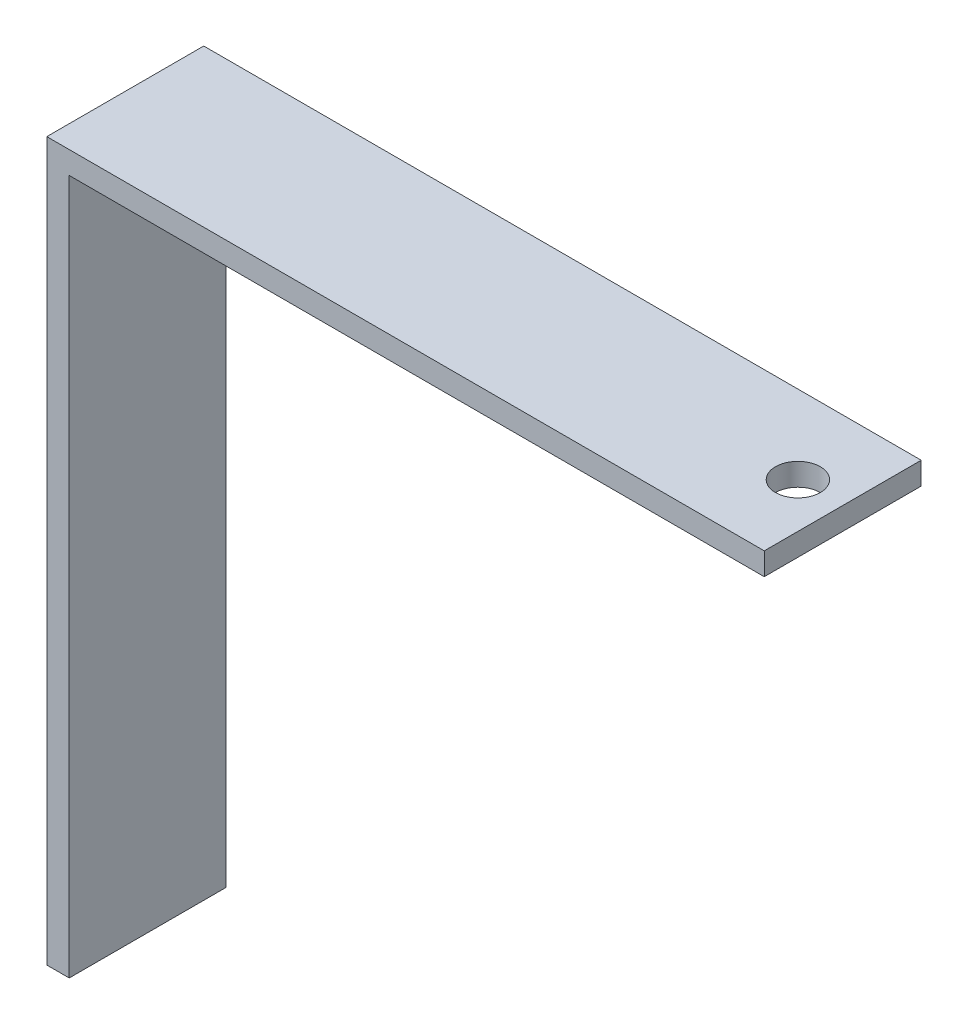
from build123d import *

# Parameters (mm, degrees)
EXTRUDE_THIN1_DEPTH = 22.225
CUT_EXTRUDE1_REACH  = 147.393
SKETCH3_R           = 3.175


with BuildPart() as part:
    # Sketch1 → Extrude-Thin1 (new body)
    with BuildSketch(Plane.XY):
        Polygon((0, 0), (0, 101.6), (101.6, 101.6), (101.6, 98.425), (3.175, 98.425), (3.175, 0), align=None)
    extrude(amount=EXTRUDE_THIN1_DEPTH)

    # Sketch3 → Cut-Extrude1 (cut, up to next)
    with BuildSketch(Plane(origin=(0, 101.6, 0), x_dir=(1, 0, 0), z_dir=(0, 1, 0)), mode=Mode.PRIVATE) as cut_extrude1_sk1:
        with Locations(Location((95.25, -11.1125, 0), (0, 0, 270))):
            Circle(SKETCH3_R)
    cut_extrude1_tool1 = extrude(cut_extrude1_sk1.sketch, amount=-CUT_EXTRUDE1_REACH, mode=Mode.PRIVATE) & part.part
    add(cut_extrude1_tool1.solids().sort_by_distance((95.25, 101.6, 11.1125))[0], mode=Mode.SUBTRACT)


solid = part.part
